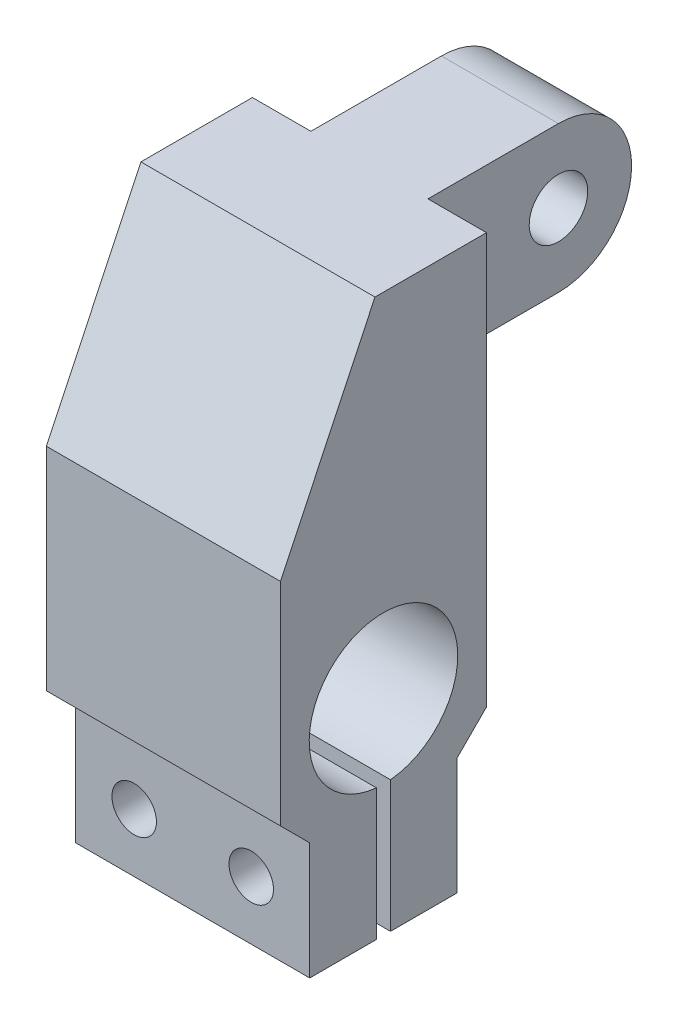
ISO-10303-21;
HEADER;
FILE_DESCRIPTION(('STEP AP214'),'2;1');
FILE_NAME('part.step','',(''),(''),'','','');
FILE_SCHEMA(('AUTOMOTIVE_DESIGN { 1 0 10303 214 1 1 1 1 }'));
ENDSEC;
DATA;
#1=APPLICATION_CONTEXT('core data for automotive mechanical design processes');
#2=APPLICATION_PROTOCOL_DEFINITION('international standard','automotive_design',2000,#1);
#3=PRODUCT_CONTEXT('',#1,'mechanical');
#4=PRODUCT('Part','Part','',(#3));
#5=PRODUCT_RELATED_PRODUCT_CATEGORY('part','',(#4));
#6=PRODUCT_DEFINITION_FORMATION('','',#4);
#7=PRODUCT_DEFINITION_CONTEXT('part definition',#1,'design');
#8=PRODUCT_DEFINITION('design','',#6,#7);
#9=PRODUCT_DEFINITION_SHAPE('','',#8);
#10=(LENGTH_UNIT() NAMED_UNIT(*) SI_UNIT(.MILLI.,.METRE.));
#11=(NAMED_UNIT(*) PLANE_ANGLE_UNIT() SI_UNIT($,.RADIAN.));
#12=(NAMED_UNIT(*) SI_UNIT($,.STERADIAN.) SOLID_ANGLE_UNIT());
#13=UNCERTAINTY_MEASURE_WITH_UNIT(LENGTH_MEASURE(1.E-05),#10,'distance_accuracy_value','');
#14=(GEOMETRIC_REPRESENTATION_CONTEXT(3) GLOBAL_UNCERTAINTY_ASSIGNED_CONTEXT((#13)) GLOBAL_UNIT_ASSIGNED_CONTEXT((#10,
#11,#12)) REPRESENTATION_CONTEXT('',''));
#15=CARTESIAN_POINT('',(0.,0.,0.));
#16=DIRECTION('',(0.,0.,1.));
#17=DIRECTION('',(1.,0.,0.));
#18=AXIS2_PLACEMENT_3D('',#15,#16,#17);
#19=CARTESIAN_POINT('',(25.4,60.452,22.352));
#20=DIRECTION('',(0.,-1.,0.));
#21=DIRECTION('',(0.,0.,-1.));
#22=AXIS2_PLACEMENT_3D('',#19,#20,#21);
#23=PLANE('',#22);
#24=DIRECTION('',(1.,0.,0.));
#25=VECTOR('',#24,1.);
#26=CARTESIAN_POINT('',(-2.50000000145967E-05,60.452,-14.1605));
#27=LINE('',#26,#25);
#28=CARTESIAN_POINT('',(6.35,60.452,-14.1605));
#29=VERTEX_POINT('',#28);
#30=CARTESIAN_POINT('',(19.05,60.452,-14.1605));
#31=VERTEX_POINT('',#30);
#32=EDGE_CURVE('E151',#29,#31,#27,.T.);
#33=ORIENTED_EDGE('',*,*,#32,.F.);
#34=DIRECTION('',(0.,0.,1.));
#35=VECTOR('',#34,1.);
#36=CARTESIAN_POINT('',(6.35,60.452,-22.098));
#37=LINE('',#36,#35);
#38=CARTESIAN_POINT('',(6.35,60.452,0.));
#39=VERTEX_POINT('',#38);
#40=EDGE_CURVE('E169',#29,#39,#37,.T.);
#41=ORIENTED_EDGE('',*,*,#40,.T.);
#42=DIRECTION('',(-1.,0.,0.));
#43=VECTOR('',#42,1.);
#44=CARTESIAN_POINT('',(25.4,60.452,0.));
#45=LINE('',#44,#43);
#46=CARTESIAN_POINT('',(0.,60.452,0.));
#47=VERTEX_POINT('',#46);
#48=EDGE_CURVE('E256',#39,#47,#45,.T.);
#49=ORIENTED_EDGE('',*,*,#48,.T.);
#50=DIRECTION('',(0.,0.,-1.));
#51=VECTOR('',#50,1.);
#52=CARTESIAN_POINT('',(0.,60.452,22.352));
#53=LINE('',#52,#51);
#54=CARTESIAN_POINT('',(0.,60.452,12.0985976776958));
#55=VERTEX_POINT('',#54);
#56=EDGE_CURVE('E285',#55,#47,#53,.T.);
#57=ORIENTED_EDGE('',*,*,#56,.F.);
#58=DIRECTION('',(-1.,0.,0.));
#59=VECTOR('',#58,1.);
#60=CARTESIAN_POINT('',(25.4,60.452,12.0985976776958));
#61=LINE('',#60,#59);
#62=CARTESIAN_POINT('',(25.4,60.452,12.0985976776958));
#63=VERTEX_POINT('',#62);
#64=EDGE_CURVE('E246',#63,#55,#61,.T.);
#65=ORIENTED_EDGE('',*,*,#64,.F.);
#66=DIRECTION('',(0.,0.,-1.));
#67=VECTOR('',#66,1.);
#68=CARTESIAN_POINT('',(25.4,60.452,22.352));
#69=LINE('',#68,#67);
#70=CARTESIAN_POINT('',(25.4,60.452,0.));
#71=VERTEX_POINT('',#70);
#72=EDGE_CURVE('E283',#63,#71,#69,.T.);
#73=ORIENTED_EDGE('',*,*,#72,.T.);
#74=CARTESIAN_POINT('',(19.05,60.452,0.));
#75=VERTEX_POINT('',#74);
#76=EDGE_CURVE('E168',#71,#75,#45,.T.);
#77=ORIENTED_EDGE('',*,*,#76,.T.);
#78=DIRECTION('',(0.,0.,1.));
#79=VECTOR('',#78,1.);
#80=CARTESIAN_POINT('',(19.05,60.452,-22.098));
#81=LINE('',#80,#79);
#82=EDGE_CURVE('E162',#31,#75,#81,.T.);
#83=ORIENTED_EDGE('',*,*,#82,.F.);
#84=EDGE_LOOP('',(#33,#41,#49,#57,#65,#73,#77,#83));
#85=FACE_BOUND('',#84,.T.);
#86=ADVANCED_FACE('F31',(#85),#23,.F.);
#87=CARTESIAN_POINT('',(19.05,60.452,-22.098));
#88=DIRECTION('',(-1.,0.,0.));
#89=DIRECTION('',(0.,-1.,0.));
#90=AXIS2_PLACEMENT_3D('',#87,#88,#89);
#91=PLANE('',#90);
#92=CARTESIAN_POINT('',(19.05,52.5145,-14.1605));
#93=DIRECTION('',(1.,0.,0.));
#94=DIRECTION('',(0.,1.,0.));
#95=AXIS2_PLACEMENT_3D('',#92,#93,#94);
#96=CIRCLE('',#95,3.175);
#97=CARTESIAN_POINT('',(19.05,55.6895,-14.1605));
#98=VERTEX_POINT('',#97);
#99=EDGE_CURVE('E418',#98,#98,#96,.T.);
#100=ORIENTED_EDGE('',*,*,#99,.F.);
#101=EDGE_LOOP('',(#100));
#102=FACE_BOUND('',#101,.T.);
#103=CARTESIAN_POINT('',(19.05,52.5145,-14.1605));
#104=DIRECTION('',(1.,0.,0.));
#105=DIRECTION('',(0.,1.,0.));
#106=AXIS2_PLACEMENT_3D('',#103,#104,#105);
#107=CIRCLE('',#106,7.93750000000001);
#108=CARTESIAN_POINT('',(19.05,44.577,-14.1605));
#109=VERTEX_POINT('',#108);
#110=EDGE_CURVE('E154',#109,#31,#107,.T.);
#111=ORIENTED_EDGE('',*,*,#110,.T.);
#112=ORIENTED_EDGE('',*,*,#82,.T.);
#113=DIRECTION('',(0.,-1.,0.));
#114=VECTOR('',#113,1.);
#115=CARTESIAN_POINT('',(19.05,60.452,0.));
#116=LINE('',#115,#114);
#117=CARTESIAN_POINT('',(19.05,44.577,0.));
#118=VERTEX_POINT('',#117);
#119=EDGE_CURVE('E184',#75,#118,#116,.T.);
#120=ORIENTED_EDGE('',*,*,#119,.T.);
#121=DIRECTION('',(0.,0.,1.));
#122=VECTOR('',#121,1.);
#123=CARTESIAN_POINT('',(19.05,44.577,-22.098));
#124=LINE('',#123,#122);
#125=EDGE_CURVE('E55',#109,#118,#124,.T.);
#126=ORIENTED_EDGE('',*,*,#125,.F.);
#127=EDGE_LOOP('',(#111,#112,#120,#126));
#128=FACE_BOUND('',#127,.T.);
#129=ADVANCED_FACE('F161',(#102,#128),#91,.F.);
#130=CARTESIAN_POINT('',(6.35,44.577,-22.098));
#131=DIRECTION('',(1.,0.,0.));
#132=DIRECTION('',(0.,0.,-1.));
#133=AXIS2_PLACEMENT_3D('',#130,#131,#132);
#134=PLANE('',#133);
#135=CARTESIAN_POINT('',(6.35,52.5145,-14.1605));
#136=DIRECTION('',(1.,0.,0.));
#137=DIRECTION('',(0.,0.,-1.));
#138=AXIS2_PLACEMENT_3D('',#135,#136,#137);
#139=CIRCLE('',#138,3.175);
#140=CARTESIAN_POINT('',(6.35,55.6895,-14.1605));
#141=VERTEX_POINT('',#140);
#142=EDGE_CURVE('E164',#141,#141,#139,.T.);
#143=ORIENTED_EDGE('',*,*,#142,.T.);
#144=EDGE_LOOP('',(#143));
#145=FACE_BOUND('',#144,.T.);
#146=ORIENTED_EDGE('',*,*,#40,.F.);
#147=CARTESIAN_POINT('',(6.35,52.5145,-14.1605));
#148=DIRECTION('',(1.,0.,0.));
#149=DIRECTION('',(0.,0.,-1.));
#150=AXIS2_PLACEMENT_3D('',#147,#148,#149);
#151=CIRCLE('',#150,7.93750000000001);
#152=CARTESIAN_POINT('',(6.35,44.577,-14.1605));
#153=VERTEX_POINT('',#152);
#154=EDGE_CURVE('E155',#153,#29,#151,.T.);
#155=ORIENTED_EDGE('',*,*,#154,.F.);
#156=DIRECTION('',(0.,0.,1.));
#157=VECTOR('',#156,1.);
#158=CARTESIAN_POINT('',(6.35,44.577,-22.098));
#159=LINE('',#158,#157);
#160=CARTESIAN_POINT('',(6.35,44.577,0.));
#161=VERTEX_POINT('',#160);
#162=EDGE_CURVE('E172',#153,#161,#159,.T.);
#163=ORIENTED_EDGE('',*,*,#162,.T.);
#164=DIRECTION('',(0.,1.,0.));
#165=VECTOR('',#164,1.);
#166=CARTESIAN_POINT('',(6.35,44.577,0.));
#167=LINE('',#166,#165);
#168=EDGE_CURVE('E170',#161,#39,#167,.T.);
#169=ORIENTED_EDGE('',*,*,#168,.T.);
#170=EDGE_LOOP('',(#146,#155,#163,#169));
#171=FACE_BOUND('',#170,.T.);
#172=ADVANCED_FACE('F319',(#145,#171),#134,.F.);
#173=CARTESIAN_POINT('',(0.,60.452,0.));
#174=DIRECTION('',(0.,0.,1.));
#175=DIRECTION('',(1.,0.,0.));
#176=AXIS2_PLACEMENT_3D('',#173,#174,#175);
#177=PLANE('',#176);
#178=ORIENTED_EDGE('',*,*,#119,.F.);
#179=ORIENTED_EDGE('',*,*,#76,.F.);
#180=DIRECTION('',(0.,-1.,0.));
#181=VECTOR('',#180,1.);
#182=CARTESIAN_POINT('',(25.4,60.452,0.));
#183=LINE('',#182,#181);
#184=CARTESIAN_POINT('',(25.4,15.875,0.));
#185=VERTEX_POINT('',#184);
#186=EDGE_CURVE('E259',#71,#185,#183,.T.);
#187=ORIENTED_EDGE('',*,*,#186,.T.);
#188=DIRECTION('',(-1.,0.,0.));
#189=VECTOR('',#188,1.);
#190=CARTESIAN_POINT('',(0.,15.875,0.));
#191=LINE('',#190,#189);
#192=CARTESIAN_POINT('',(0.,15.875,0.));
#193=VERTEX_POINT('',#192);
#194=EDGE_CURVE('E272',#185,#193,#191,.T.);
#195=ORIENTED_EDGE('',*,*,#194,.T.);
#196=DIRECTION('',(0.,1.,0.));
#197=VECTOR('',#196,1.);
#198=CARTESIAN_POINT('',(0.,0.,0.));
#199=LINE('',#198,#197);
#200=EDGE_CURVE('E253',#193,#47,#199,.T.);
#201=ORIENTED_EDGE('',*,*,#200,.T.);
#202=ORIENTED_EDGE('',*,*,#48,.F.);
#203=ORIENTED_EDGE('',*,*,#168,.F.);
#204=DIRECTION('',(1.,0.,0.));
#205=VECTOR('',#204,1.);
#206=CARTESIAN_POINT('',(6.35,44.577,0.));
#207=LINE('',#206,#205);
#208=EDGE_CURVE('E175',#161,#118,#207,.T.);
#209=ORIENTED_EDGE('',*,*,#208,.T.);
#210=EDGE_LOOP('',(#178,#179,#187,#195,#201,#202,#203,#209));
#211=FACE_BOUND('',#210,.T.);
#212=ADVANCED_FACE('F298',(#211),#177,.F.);
#213=CARTESIAN_POINT('',(0.,0.,22.352));
#214=DIRECTION('',(0.,1.,0.));
#215=DIRECTION('',(0.,0.,1.));
#216=AXIS2_PLACEMENT_3D('',#213,#214,#215);
#217=PLANE('',#216);
#218=DIRECTION('',(1.,0.,0.));
#219=VECTOR('',#218,1.);
#220=CARTESIAN_POINT('',(0.,0.,10.414));
#221=LINE('',#220,#219);
#222=CARTESIAN_POINT('',(0.,0.,10.414));
#223=VERTEX_POINT('',#222);
#224=CARTESIAN_POINT('',(25.4,0.,10.414));
#225=VERTEX_POINT('',#224);
#226=EDGE_CURVE('E203',#223,#225,#221,.T.);
#227=ORIENTED_EDGE('',*,*,#226,.F.);
#228=DIRECTION('',(0.,0.,-1.));
#229=VECTOR('',#228,1.);
#230=CARTESIAN_POINT('',(0.,0.,22.352));
#231=LINE('',#230,#229);
#232=CARTESIAN_POINT('',(0.,0.,3.175));
#233=VERTEX_POINT('',#232);
#234=EDGE_CURVE('E278',#223,#233,#231,.T.);
#235=ORIENTED_EDGE('',*,*,#234,.T.);
#236=DIRECTION('',(1.,0.,0.));
#237=VECTOR('',#236,1.);
#238=CARTESIAN_POINT('',(0.,0.,3.175));
#239=LINE('',#238,#237);
#240=CARTESIAN_POINT('',(25.4,0.,3.175));
#241=VERTEX_POINT('',#240);
#242=EDGE_CURVE('E248',#233,#241,#239,.T.);
#243=ORIENTED_EDGE('',*,*,#242,.T.);
#244=DIRECTION('',(0.,0.,-1.));
#245=VECTOR('',#244,1.);
#246=CARTESIAN_POINT('',(25.4,0.,22.352));
#247=LINE('',#246,#245);
#248=EDGE_CURVE('E282',#225,#241,#247,.T.);
#249=ORIENTED_EDGE('',*,*,#248,.F.);
#250=EDGE_LOOP('',(#227,#235,#243,#249));
#251=FACE_BOUND('',#250,.T.);
#252=ADVANCED_FACE('F353',(#251),#217,.F.);
#253=CARTESIAN_POINT('',(0.,0.,22.352));
#254=DIRECTION('',(-1.,0.,0.));
#255=DIRECTION('',(0.,0.,1.));
#256=AXIS2_PLACEMENT_3D('',#253,#254,#255);
#257=PLANE('',#256);
#258=DIRECTION('',(0.,-1.,0.));
#259=VECTOR('',#258,1.);
#260=CARTESIAN_POINT('',(0.,15.875,11.938));
#261=LINE('',#260,#259);
#262=CARTESIAN_POINT('',(0.,14.2507150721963,11.938));
#263=VERTEX_POINT('',#262);
#264=CARTESIAN_POINT('',(0.,0.,11.938));
#265=VERTEX_POINT('',#264);
#266=EDGE_CURVE('E200',#263,#265,#261,.T.);
#267=ORIENTED_EDGE('',*,*,#266,.T.);
#268=CARTESIAN_POINT('',(0.,0.,19.177));
#269=VERTEX_POINT('',#268);
#270=EDGE_CURVE('E275',#269,#265,#231,.T.);
#271=ORIENTED_EDGE('',*,*,#270,.F.);
#272=DIRECTION('',(0.,-1.,0.));
#273=VECTOR('',#272,1.);
#274=CARTESIAN_POINT('',(0.,12.7,19.177));
#275=LINE('',#274,#273);
#276=CARTESIAN_POINT('',(0.,12.7,19.177));
#277=VERTEX_POINT('',#276);
#278=EDGE_CURVE('E237',#277,#269,#275,.T.);
#279=ORIENTED_EDGE('',*,*,#278,.F.);
#280=DIRECTION('',(0.,-0.707106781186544,-0.707106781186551));
#281=VECTOR('',#280,1.);
#282=CARTESIAN_POINT('',(0.,21.2602168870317,27.7372168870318));
#283=LINE('',#282,#281);
#284=CARTESIAN_POINT('',(0.,15.875,22.352));
#285=VERTEX_POINT('',#284);
#286=EDGE_CURVE('E239',#285,#277,#283,.T.);
#287=ORIENTED_EDGE('',*,*,#286,.F.);
#288=DIRECTION('',(0.,1.,0.));
#289=VECTOR('',#288,1.);
#290=CARTESIAN_POINT('',(0.,0.,22.352));
#291=LINE('',#290,#289);
#292=CARTESIAN_POINT('',(0.,38.8583848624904,22.352));
#293=VERTEX_POINT('',#292);
#294=EDGE_CURVE('E290',#285,#293,#291,.T.);
#295=ORIENTED_EDGE('',*,*,#294,.T.);
#296=DIRECTION('',(0.,0.9033352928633,-0.428935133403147));
#297=VECTOR('',#296,1.);
#298=CARTESIAN_POINT('',(0.,58.6028956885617,12.9766169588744));
#299=LINE('',#298,#297);
#300=EDGE_CURVE('E228',#293,#55,#299,.T.);
#301=ORIENTED_EDGE('',*,*,#300,.T.);
#302=ORIENTED_EDGE('',*,*,#56,.T.);
#303=ORIENTED_EDGE('',*,*,#200,.F.);
#304=DIRECTION('',(0.,-0.707106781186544,0.707106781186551));
#305=VECTOR('',#304,1.);
#306=CARTESIAN_POINT('',(0.,17.618714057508,-1.74371405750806));
#307=LINE('',#306,#305);
#308=CARTESIAN_POINT('',(0.,12.7,3.175));
#309=VERTEX_POINT('',#308);
#310=EDGE_CURVE('E231',#193,#309,#307,.T.);
#311=ORIENTED_EDGE('',*,*,#310,.T.);
#312=DIRECTION('',(0.,-1.,0.));
#313=VECTOR('',#312,1.);
#314=CARTESIAN_POINT('',(0.,12.7,3.175));
#315=LINE('',#314,#313);
#316=EDGE_CURVE('E234',#309,#233,#315,.T.);
#317=ORIENTED_EDGE('',*,*,#316,.T.);
#318=ORIENTED_EDGE('',*,*,#234,.F.);
#319=DIRECTION('',(0.,-1.,0.));
#320=VECTOR('',#319,1.);
#321=CARTESIAN_POINT('',(0.,15.875,10.414));
#322=LINE('',#321,#320);
#323=CARTESIAN_POINT('',(0.,14.2507150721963,10.414));
#324=VERTEX_POINT('',#323);
#325=EDGE_CURVE('E198',#324,#223,#322,.T.);
#326=ORIENTED_EDGE('',*,*,#325,.F.);
#327=CARTESIAN_POINT('',(0.,22.2758,11.176));
#328=DIRECTION('',(1.,0.,0.));
#329=DIRECTION('',(0.,1.,0.));
#330=AXIS2_PLACEMENT_3D('',#327,#328,#329);
#331=CIRCLE('',#330,8.06118056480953);
#332=EDGE_CURVE('E208',#324,#263,#331,.T.);
#333=ORIENTED_EDGE('',*,*,#332,.T.);
#334=EDGE_LOOP('',(#267,#271,#279,#287,#295,#301,#302,#303,#311,#317,#318,#326,#333));
#335=FACE_BOUND('',#334,.T.);
#336=ADVANCED_FACE('F313',(#335),#257,.T.);
#337=ORIENTED_EDGE('',*,*,#270,.T.);
#338=DIRECTION('',(1.,0.,0.));
#339=VECTOR('',#338,1.);
#340=CARTESIAN_POINT('',(0.,0.,11.938));
#341=LINE('',#340,#339);
#342=CARTESIAN_POINT('',(25.4,0.,11.938));
#343=VERTEX_POINT('',#342);
#344=EDGE_CURVE('E205',#265,#343,#341,.T.);
#345=ORIENTED_EDGE('',*,*,#344,.T.);
#346=CARTESIAN_POINT('',(25.4,0.,19.177));
#347=VERTEX_POINT('',#346);
#348=EDGE_CURVE('E279',#347,#343,#247,.T.);
#349=ORIENTED_EDGE('',*,*,#348,.F.);
#350=DIRECTION('',(1.,0.,0.));
#351=VECTOR('',#350,1.);
#352=CARTESIAN_POINT('',(0.,0.,19.177));
#353=LINE('',#352,#351);
#354=EDGE_CURVE('E251',#269,#347,#353,.T.);
#355=ORIENTED_EDGE('',*,*,#354,.F.);
#356=EDGE_LOOP('',(#337,#345,#349,#355));
#357=FACE_BOUND('',#356,.T.);
#358=ADVANCED_FACE('F33',(#357),#217,.F.);
#359=CARTESIAN_POINT('',(25.4,60.452,22.352));
#360=DIRECTION('',(1.,0.,0.));
#361=DIRECTION('',(0.,1.,0.));
#362=AXIS2_PLACEMENT_3D('',#359,#360,#361);
#363=PLANE('',#362);
#364=DIRECTION('',(0.,-1.,0.));
#365=VECTOR('',#364,1.);
#366=CARTESIAN_POINT('',(25.4,15.875,11.938));
#367=LINE('',#366,#365);
#368=CARTESIAN_POINT('',(25.4,14.2507150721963,11.938));
#369=VERTEX_POINT('',#368);
#370=EDGE_CURVE('E196',#369,#343,#367,.T.);
#371=ORIENTED_EDGE('',*,*,#370,.F.);
#372=CARTESIAN_POINT('',(25.4,22.2758,11.176));
#373=DIRECTION('',(1.,0.,0.));
#374=DIRECTION('',(0.,1.,0.));
#375=AXIS2_PLACEMENT_3D('',#372,#373,#374);
#376=CIRCLE('',#375,8.06118056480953);
#377=CARTESIAN_POINT('',(25.4,14.2507150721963,10.414));
#378=VERTEX_POINT('',#377);
#379=EDGE_CURVE('E211',#378,#369,#376,.T.);
#380=ORIENTED_EDGE('',*,*,#379,.F.);
#381=DIRECTION('',(0.,-1.,0.));
#382=VECTOR('',#381,1.);
#383=CARTESIAN_POINT('',(25.4,15.875,10.414));
#384=LINE('',#383,#382);
#385=EDGE_CURVE('E193',#378,#225,#384,.T.);
#386=ORIENTED_EDGE('',*,*,#385,.T.);
#387=ORIENTED_EDGE('',*,*,#248,.T.);
#388=DIRECTION('',(0.,-1.,0.));
#389=VECTOR('',#388,1.);
#390=CARTESIAN_POINT('',(25.4,12.7,3.175));
#391=LINE('',#390,#389);
#392=CARTESIAN_POINT('',(25.4,12.7,3.175));
#393=VERTEX_POINT('',#392);
#394=EDGE_CURVE('E216',#393,#241,#391,.T.);
#395=ORIENTED_EDGE('',*,*,#394,.F.);
#396=DIRECTION('',(0.,-0.707106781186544,0.707106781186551));
#397=VECTOR('',#396,1.);
#398=CARTESIAN_POINT('',(25.4,17.618714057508,-1.74371405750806));
#399=LINE('',#398,#397);
#400=EDGE_CURVE('E214',#185,#393,#399,.T.);
#401=ORIENTED_EDGE('',*,*,#400,.F.);
#402=ORIENTED_EDGE('',*,*,#186,.F.);
#403=ORIENTED_EDGE('',*,*,#72,.F.);
#404=DIRECTION('',(0.,-0.9033352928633,0.428935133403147));
#405=VECTOR('',#404,1.);
#406=CARTESIAN_POINT('',(25.4,58.6028956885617,12.9766169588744));
#407=LINE('',#406,#405);
#408=CARTESIAN_POINT('',(25.4,38.8583848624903,22.352));
#409=VERTEX_POINT('',#408);
#410=EDGE_CURVE('E225',#63,#409,#407,.T.);
#411=ORIENTED_EDGE('',*,*,#410,.T.);
#412=DIRECTION('',(0.,-1.,0.));
#413=VECTOR('',#412,1.);
#414=CARTESIAN_POINT('',(25.4,60.452,22.352));
#415=LINE('',#414,#413);
#416=CARTESIAN_POINT('',(25.4,15.875,22.352));
#417=VERTEX_POINT('',#416);
#418=EDGE_CURVE('E288',#409,#417,#415,.T.);
#419=ORIENTED_EDGE('',*,*,#418,.T.);
#420=DIRECTION('',(0.,-0.707106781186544,-0.707106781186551));
#421=VECTOR('',#420,1.);
#422=CARTESIAN_POINT('',(25.4,21.2602168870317,27.7372168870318));
#423=LINE('',#422,#421);
#424=CARTESIAN_POINT('',(25.4,12.7,19.177));
#425=VERTEX_POINT('',#424);
#426=EDGE_CURVE('E222',#417,#425,#423,.T.);
#427=ORIENTED_EDGE('',*,*,#426,.T.);
#428=DIRECTION('',(0.,-1.,0.));
#429=VECTOR('',#428,1.);
#430=CARTESIAN_POINT('',(25.4,12.7,19.177));
#431=LINE('',#430,#429);
#432=EDGE_CURVE('E219',#425,#347,#431,.T.);
#433=ORIENTED_EDGE('',*,*,#432,.T.);
#434=ORIENTED_EDGE('',*,*,#348,.T.);
#435=EDGE_LOOP('',(#371,#380,#386,#387,#395,#401,#402,#403,#411,#419,#427,#433,#434));
#436=FACE_BOUND('',#435,.T.);
#437=ADVANCED_FACE('F304',(#436),#363,.T.);
#438=CARTESIAN_POINT('',(0.,60.452,22.352));
#439=DIRECTION('',(0.,0.,1.));
#440=DIRECTION('',(1.,0.,0.));
#441=AXIS2_PLACEMENT_3D('',#438,#439,#440);
#442=PLANE('',#441);
#443=ORIENTED_EDGE('',*,*,#418,.F.);
#444=DIRECTION('',(-1.,0.,0.));
#445=VECTOR('',#444,1.);
#446=CARTESIAN_POINT('',(0.,38.8583848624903,22.352));
#447=LINE('',#446,#445);
#448=EDGE_CURVE('E266',#409,#293,#447,.T.);
#449=ORIENTED_EDGE('',*,*,#448,.T.);
#450=ORIENTED_EDGE('',*,*,#294,.F.);
#451=DIRECTION('',(1.,0.,0.));
#452=VECTOR('',#451,1.);
#453=CARTESIAN_POINT('',(0.,15.875,22.352));
#454=LINE('',#453,#452);
#455=EDGE_CURVE('E269',#285,#417,#454,.T.);
#456=ORIENTED_EDGE('',*,*,#455,.T.);
#457=EDGE_LOOP('',(#443,#449,#450,#456));
#458=FACE_BOUND('',#457,.T.);
#459=ADVANCED_FACE('F346',(#458),#442,.T.);
#460=CARTESIAN_POINT('',(0.,17.618714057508,-1.74371405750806));
#461=DIRECTION('',(0.,0.707106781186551,0.707106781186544));
#462=DIRECTION('',(0.,-0.707106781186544,0.707106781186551));
#463=AXIS2_PLACEMENT_3D('',#460,#461,#462);
#464=PLANE('',#463);
#465=ORIENTED_EDGE('',*,*,#400,.T.);
#466=DIRECTION('',(1.,0.,0.));
#467=VECTOR('',#466,1.);
#468=CARTESIAN_POINT('',(0.,12.7,3.175));
#469=LINE('',#468,#467);
#470=EDGE_CURVE('E241',#309,#393,#469,.T.);
#471=ORIENTED_EDGE('',*,*,#470,.F.);
#472=ORIENTED_EDGE('',*,*,#310,.F.);
#473=ORIENTED_EDGE('',*,*,#194,.F.);
#474=EDGE_LOOP('',(#465,#471,#472,#473));
#475=FACE_BOUND('',#474,.T.);
#476=ADVANCED_FACE('F307',(#475),#464,.F.);
#477=CARTESIAN_POINT('',(0.,12.7,3.175));
#478=DIRECTION('',(0.,0.,1.));
#479=DIRECTION('',(1.,0.,0.));
#480=AXIS2_PLACEMENT_3D('',#477,#478,#479);
#481=PLANE('',#480);
#482=CARTESIAN_POINT('',(6.35000000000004,6.34999999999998,3.175));
#483=DIRECTION('',(0.,0.,1.));
#484=DIRECTION('',(1.,0.,0.));
#485=AXIS2_PLACEMENT_3D('',#482,#483,#484);
#486=CIRCLE('',#485,2.413);
#487=CARTESIAN_POINT('',(8.76300000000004,6.34999999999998,3.175));
#488=VERTEX_POINT('',#487);
#489=EDGE_CURVE('E574',#488,#488,#486,.T.);
#490=ORIENTED_EDGE('',*,*,#489,.T.);
#491=EDGE_LOOP('',(#490));
#492=FACE_BOUND('',#491,.T.);
#493=CARTESIAN_POINT('',(19.05,6.34999999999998,3.175));
#494=DIRECTION('',(0.,0.,1.));
#495=DIRECTION('',(1.,0.,0.));
#496=AXIS2_PLACEMENT_3D('',#493,#494,#495);
#497=CIRCLE('',#496,2.413);
#498=CARTESIAN_POINT('',(21.463,6.34999999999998,3.175));
#499=VERTEX_POINT('',#498);
#500=EDGE_CURVE('E414',#499,#499,#497,.T.);
#501=ORIENTED_EDGE('',*,*,#500,.T.);
#502=EDGE_LOOP('',(#501));
#503=FACE_BOUND('',#502,.T.);
#504=ORIENTED_EDGE('',*,*,#316,.F.);
#505=ORIENTED_EDGE('',*,*,#470,.T.);
#506=ORIENTED_EDGE('',*,*,#394,.T.);
#507=ORIENTED_EDGE('',*,*,#242,.F.);
#508=EDGE_LOOP('',(#504,#505,#506,#507));
#509=FACE_BOUND('',#508,.T.);
#510=ADVANCED_FACE('F310',(#492,#503,#509),#481,.F.);
#511=CARTESIAN_POINT('',(0.,21.2602168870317,27.7372168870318));
#512=DIRECTION('',(0.,-0.707106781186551,0.707106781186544));
#513=DIRECTION('',(0.,-0.707106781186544,-0.707106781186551));
#514=AXIS2_PLACEMENT_3D('',#511,#512,#513);
#515=PLANE('',#514);
#516=ORIENTED_EDGE('',*,*,#286,.T.);
#517=DIRECTION('',(1.,0.,0.));
#518=VECTOR('',#517,1.);
#519=CARTESIAN_POINT('',(0.,12.7,19.177));
#520=LINE('',#519,#518);
#521=EDGE_CURVE('E244',#277,#425,#520,.T.);
#522=ORIENTED_EDGE('',*,*,#521,.T.);
#523=ORIENTED_EDGE('',*,*,#426,.F.);
#524=ORIENTED_EDGE('',*,*,#455,.F.);
#525=EDGE_LOOP('',(#516,#522,#523,#524));
#526=FACE_BOUND('',#525,.T.);
#527=ADVANCED_FACE('F382',(#526),#515,.T.);
#528=CARTESIAN_POINT('',(0.,12.7,19.177));
#529=DIRECTION('',(0.,0.,1.));
#530=DIRECTION('',(1.,0.,0.));
#531=AXIS2_PLACEMENT_3D('',#528,#529,#530);
#532=PLANE('',#531);
#533=CARTESIAN_POINT('',(6.35000000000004,6.34999999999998,19.177));
#534=DIRECTION('',(0.,0.,1.));
#535=DIRECTION('',(1.,0.,0.));
#536=AXIS2_PLACEMENT_3D('',#533,#534,#535);
#537=CIRCLE('',#536,2.413);
#538=CARTESIAN_POINT('',(8.76300000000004,6.34999999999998,19.177));
#539=VERTEX_POINT('',#538);
#540=EDGE_CURVE('E578',#539,#539,#537,.T.);
#541=ORIENTED_EDGE('',*,*,#540,.F.);
#542=EDGE_LOOP('',(#541));
#543=FACE_BOUND('',#542,.T.);
#544=CARTESIAN_POINT('',(19.05,6.34999999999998,19.177));
#545=DIRECTION('',(0.,0.,1.));
#546=DIRECTION('',(1.,0.,0.));
#547=AXIS2_PLACEMENT_3D('',#544,#545,#546);
#548=CIRCLE('',#547,2.413);
#549=CARTESIAN_POINT('',(21.463,6.34999999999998,19.177));
#550=VERTEX_POINT('',#549);
#551=EDGE_CURVE('E421',#550,#550,#548,.T.);
#552=ORIENTED_EDGE('',*,*,#551,.F.);
#553=EDGE_LOOP('',(#552));
#554=FACE_BOUND('',#553,.T.);
#555=ORIENTED_EDGE('',*,*,#354,.T.);
#556=ORIENTED_EDGE('',*,*,#432,.F.);
#557=ORIENTED_EDGE('',*,*,#521,.F.);
#558=ORIENTED_EDGE('',*,*,#278,.T.);
#559=EDGE_LOOP('',(#555,#556,#557,#558));
#560=FACE_BOUND('',#559,.T.);
#561=ADVANCED_FACE('F380',(#543,#554,#560),#532,.T.);
#562=CARTESIAN_POINT('',(0.,58.6028956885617,12.9766169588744));
#563=DIRECTION('',(0.,0.428935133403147,0.9033352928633));
#564=DIRECTION('',(0.,-0.9033352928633,0.428935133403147));
#565=AXIS2_PLACEMENT_3D('',#562,#563,#564);
#566=PLANE('',#565);
#567=ORIENTED_EDGE('',*,*,#64,.T.);
#568=ORIENTED_EDGE('',*,*,#300,.F.);
#569=ORIENTED_EDGE('',*,*,#448,.F.);
#570=ORIENTED_EDGE('',*,*,#410,.F.);
#571=EDGE_LOOP('',(#567,#568,#569,#570));
#572=FACE_BOUND('',#571,.T.);
#573=ADVANCED_FACE('F385',(#572),#566,.T.);
#574=CARTESIAN_POINT('',(0.,22.2758,11.176));
#575=DIRECTION('',(1.,0.,0.));
#576=DIRECTION('',(0.,1.,0.));
#577=AXIS2_PLACEMENT_3D('',#574,#575,#576);
#578=CYLINDRICAL_SURFACE('',#577,8.06118056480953);
#579=ORIENTED_EDGE('',*,*,#379,.T.);
#580=DIRECTION('',(1.,0.,0.));
#581=VECTOR('',#580,1.);
#582=CARTESIAN_POINT('',(0.,14.2507150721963,11.938));
#583=LINE('',#582,#581);
#584=EDGE_CURVE('E11',#369,#263,#583,.F.);
#585=ORIENTED_EDGE('',*,*,#584,.T.);
#586=ORIENTED_EDGE('',*,*,#332,.F.);
#587=DIRECTION('',(1.,0.,0.));
#588=VECTOR('',#587,1.);
#589=CARTESIAN_POINT('',(0.,14.2507150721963,10.414));
#590=LINE('',#589,#588);
#591=EDGE_CURVE('E40',#378,#324,#590,.F.);
#592=ORIENTED_EDGE('',*,*,#591,.F.);
#593=EDGE_LOOP('',(#579,#585,#586,#592));
#594=FACE_BOUND('',#593,.T.);
#595=ADVANCED_FACE('F370',(#594),#578,.F.);
#596=CARTESIAN_POINT('',(0.,15.875,10.414));
#597=DIRECTION('',(0.,0.,1.));
#598=DIRECTION('',(0.,-1.,0.));
#599=AXIS2_PLACEMENT_3D('',#596,#597,#598);
#600=PLANE('',#599);
#601=CARTESIAN_POINT('',(6.35000000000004,6.34999999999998,10.414));
#602=DIRECTION('',(0.,0.,1.));
#603=DIRECTION('',(0.,-1.,0.));
#604=AXIS2_PLACEMENT_3D('',#601,#602,#603);
#605=CIRCLE('',#604,2.413);
#606=CARTESIAN_POINT('',(6.35000000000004,3.93699999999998,10.414));
#607=VERTEX_POINT('',#606);
#608=EDGE_CURVE('E409',#607,#607,#605,.T.);
#609=ORIENTED_EDGE('',*,*,#608,.F.);
#610=EDGE_LOOP('',(#609));
#611=FACE_BOUND('',#610,.T.);
#612=CARTESIAN_POINT('',(19.05,6.34999999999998,10.414));
#613=DIRECTION('',(0.,0.,1.));
#614=DIRECTION('',(0.,-1.,0.));
#615=AXIS2_PLACEMENT_3D('',#612,#613,#614);
#616=CIRCLE('',#615,2.413);
#617=CARTESIAN_POINT('',(19.05,3.93699999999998,10.414));
#618=VERTEX_POINT('',#617);
#619=EDGE_CURVE('E412',#618,#618,#616,.T.);
#620=ORIENTED_EDGE('',*,*,#619,.F.);
#621=EDGE_LOOP('',(#620));
#622=FACE_BOUND('',#621,.T.);
#623=ORIENTED_EDGE('',*,*,#226,.T.);
#624=ORIENTED_EDGE('',*,*,#385,.F.);
#625=ORIENTED_EDGE('',*,*,#591,.T.);
#626=ORIENTED_EDGE('',*,*,#325,.T.);
#627=EDGE_LOOP('',(#623,#624,#625,#626));
#628=FACE_BOUND('',#627,.T.);
#629=ADVANCED_FACE('F331',(#611,#622,#628),#600,.T.);
#630=CARTESIAN_POINT('',(0.,15.875,11.938));
#631=DIRECTION('',(0.,0.,1.));
#632=DIRECTION('',(0.,-1.,0.));
#633=AXIS2_PLACEMENT_3D('',#630,#631,#632);
#634=PLANE('',#633);
#635=CARTESIAN_POINT('',(6.35000000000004,6.34999999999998,11.938));
#636=DIRECTION('',(0.,0.,1.));
#637=DIRECTION('',(0.,-1.,0.));
#638=AXIS2_PLACEMENT_3D('',#635,#636,#637);
#639=CIRCLE('',#638,2.413);
#640=CARTESIAN_POINT('',(6.35000000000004,3.93699999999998,11.938));
#641=VERTEX_POINT('',#640);
#642=EDGE_CURVE('E35',#641,#641,#639,.T.);
#643=ORIENTED_EDGE('',*,*,#642,.T.);
#644=EDGE_LOOP('',(#643));
#645=FACE_BOUND('',#644,.T.);
#646=CARTESIAN_POINT('',(19.05,6.34999999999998,11.938));
#647=DIRECTION('',(0.,0.,1.));
#648=DIRECTION('',(0.,-1.,0.));
#649=AXIS2_PLACEMENT_3D('',#646,#647,#648);
#650=CIRCLE('',#649,2.413);
#651=CARTESIAN_POINT('',(19.05,3.93699999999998,11.938));
#652=VERTEX_POINT('',#651);
#653=EDGE_CURVE('E415',#652,#652,#650,.T.);
#654=ORIENTED_EDGE('',*,*,#653,.T.);
#655=EDGE_LOOP('',(#654));
#656=FACE_BOUND('',#655,.T.);
#657=ORIENTED_EDGE('',*,*,#266,.F.);
#658=ORIENTED_EDGE('',*,*,#584,.F.);
#659=ORIENTED_EDGE('',*,*,#370,.T.);
#660=ORIENTED_EDGE('',*,*,#344,.F.);
#661=EDGE_LOOP('',(#657,#658,#659,#660));
#662=FACE_BOUND('',#661,.T.);
#663=ADVANCED_FACE('F323',(#645,#656,#662),#634,.F.);
#664=CARTESIAN_POINT('',(6.35,44.577,-22.098));
#665=DIRECTION('',(0.,-1.,0.));
#666=DIRECTION('',(0.,0.,-1.));
#667=AXIS2_PLACEMENT_3D('',#664,#665,#666);
#668=PLANE('',#667);
#669=DIRECTION('',(1.,0.,0.));
#670=VECTOR('',#669,1.);
#671=CARTESIAN_POINT('',(-2.50000000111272E-05,44.577,-14.1605));
#672=LINE('',#671,#670);
#673=EDGE_CURVE('E48',#153,#109,#672,.T.);
#674=ORIENTED_EDGE('',*,*,#673,.T.);
#675=ORIENTED_EDGE('',*,*,#125,.T.);
#676=ORIENTED_EDGE('',*,*,#208,.F.);
#677=ORIENTED_EDGE('',*,*,#162,.F.);
#678=EDGE_LOOP('',(#674,#675,#676,#677));
#679=FACE_BOUND('',#678,.T.);
#680=ADVANCED_FACE('F321',(#679),#668,.T.);
#681=CARTESIAN_POINT('',(-2.50000000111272E-05,52.5145,-14.1605));
#682=DIRECTION('',(1.,0.,0.));
#683=DIRECTION('',(0.,1.,0.));
#684=AXIS2_PLACEMENT_3D('',#681,#682,#683);
#685=CYLINDRICAL_SURFACE('',#684,7.93750000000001);
#686=ORIENTED_EDGE('',*,*,#154,.T.);
#687=ORIENTED_EDGE('',*,*,#32,.T.);
#688=ORIENTED_EDGE('',*,*,#110,.F.);
#689=ORIENTED_EDGE('',*,*,#673,.F.);
#690=EDGE_LOOP('',(#686,#687,#688,#689));
#691=FACE_BOUND('',#690,.T.);
#692=ADVANCED_FACE('F153',(#691),#685,.T.);
#693=CARTESIAN_POINT('',(-2.50000000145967E-05,52.5145,-14.1605));
#694=DIRECTION('',(1.,0.,0.));
#695=DIRECTION('',(0.,1.,0.));
#696=AXIS2_PLACEMENT_3D('',#693,#694,#695);
#697=CYLINDRICAL_SURFACE('',#696,3.175);
#698=CARTESIAN_POINT('',(19.05,55.6895,-14.1605));
#699=CARTESIAN_POINT('',(18.9177083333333,55.6895,-14.1605));
#700=CARTESIAN_POINT('',(18.7854166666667,55.6895,-14.1605));
#701=CARTESIAN_POINT('',(18.5208333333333,55.6895,-14.1605));
#702=CARTESIAN_POINT('',(18.3885416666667,55.6895,-14.1605));
#703=CARTESIAN_POINT('',(18.1239583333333,55.6895,-14.1605));
#704=CARTESIAN_POINT('',(17.9916666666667,55.6895,-14.1605));
#705=CARTESIAN_POINT('',(17.7270833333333,55.6895,-14.1605));
#706=CARTESIAN_POINT('',(17.5947916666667,55.6895,-14.1605));
#707=CARTESIAN_POINT('',(17.3302083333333,55.6895,-14.1605));
#708=CARTESIAN_POINT('',(17.1979166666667,55.6895,-14.1605));
#709=CARTESIAN_POINT('',(16.9333333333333,55.6895,-14.1605));
#710=CARTESIAN_POINT('',(16.8010416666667,55.6895,-14.1605));
#711=CARTESIAN_POINT('',(16.5364583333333,55.6895,-14.1605));
#712=CARTESIAN_POINT('',(16.4041666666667,55.6895,-14.1605));
#713=CARTESIAN_POINT('',(16.1395833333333,55.6895,-14.1605));
#714=CARTESIAN_POINT('',(16.0072916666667,55.6895,-14.1605));
#715=CARTESIAN_POINT('',(15.7427083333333,55.6895,-14.1605));
#716=CARTESIAN_POINT('',(15.6104166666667,55.6895,-14.1605));
#717=CARTESIAN_POINT('',(15.3458333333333,55.6895,-14.1605));
#718=CARTESIAN_POINT('',(15.2135416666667,55.6895,-14.1605));
#719=CARTESIAN_POINT('',(14.9489583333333,55.6895,-14.1605));
#720=CARTESIAN_POINT('',(14.8166666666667,55.6895,-14.1605));
#721=CARTESIAN_POINT('',(14.5520833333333,55.6895,-14.1605));
#722=CARTESIAN_POINT('',(14.4197916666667,55.6895,-14.1605));
#723=CARTESIAN_POINT('',(14.1552083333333,55.6895,-14.1605));
#724=CARTESIAN_POINT('',(14.0229166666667,55.6895,-14.1605));
#725=CARTESIAN_POINT('',(13.7583333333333,55.6895,-14.1605));
#726=CARTESIAN_POINT('',(13.6260416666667,55.6895,-14.1605));
#727=CARTESIAN_POINT('',(13.3614583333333,55.6895,-14.1605));
#728=CARTESIAN_POINT('',(13.2291666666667,55.6895,-14.1605));
#729=CARTESIAN_POINT('',(12.9645833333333,55.6895,-14.1605));
#730=CARTESIAN_POINT('',(12.8322916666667,55.6895,-14.1605));
#731=CARTESIAN_POINT('',(12.5677083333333,55.6895,-14.1605));
#732=CARTESIAN_POINT('',(12.4354166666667,55.6895,-14.1605));
#733=CARTESIAN_POINT('',(12.1708333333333,55.6895,-14.1605));
#734=CARTESIAN_POINT('',(12.0385416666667,55.6895,-14.1605));
#735=CARTESIAN_POINT('',(11.7739583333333,55.6895,-14.1605));
#736=CARTESIAN_POINT('',(11.6416666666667,55.6895,-14.1605));
#737=CARTESIAN_POINT('',(11.3770833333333,55.6895,-14.1605));
#738=CARTESIAN_POINT('',(11.2447916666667,55.6895,-14.1605));
#739=CARTESIAN_POINT('',(10.9802083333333,55.6895,-14.1605));
#740=CARTESIAN_POINT('',(10.8479166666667,55.6895,-14.1605));
#741=CARTESIAN_POINT('',(10.5833333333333,55.6895,-14.1605));
#742=CARTESIAN_POINT('',(10.4510416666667,55.6895,-14.1605));
#743=CARTESIAN_POINT('',(10.1864583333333,55.6895,-14.1605));
#744=CARTESIAN_POINT('',(10.0541666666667,55.6895,-14.1605));
#745=CARTESIAN_POINT('',(9.78958333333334,55.6895,-14.1605));
#746=CARTESIAN_POINT('',(9.65729166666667,55.6895,-14.1605));
#747=CARTESIAN_POINT('',(9.39270833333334,55.6895,-14.1605));
#748=CARTESIAN_POINT('',(9.26041666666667,55.6895,-14.1605));
#749=CARTESIAN_POINT('',(8.99583333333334,55.6895,-14.1605));
#750=CARTESIAN_POINT('',(8.86354166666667,55.6895,-14.1605));
#751=CARTESIAN_POINT('',(8.59895833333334,55.6895,-14.1605));
#752=CARTESIAN_POINT('',(8.46666666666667,55.6895,-14.1605));
#753=CARTESIAN_POINT('',(8.20208333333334,55.6895,-14.1605));
#754=CARTESIAN_POINT('',(8.06979166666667,55.6895,-14.1605));
#755=CARTESIAN_POINT('',(7.80520833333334,55.6895,-14.1605));
#756=CARTESIAN_POINT('',(7.67291666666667,55.6895,-14.1605));
#757=CARTESIAN_POINT('',(7.40833333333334,55.6895,-14.1605));
#758=CARTESIAN_POINT('',(7.27604166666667,55.6895,-14.1605));
#759=CARTESIAN_POINT('',(7.01145833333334,55.6895,-14.1605));
#760=CARTESIAN_POINT('',(6.87916666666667,55.6895,-14.1605));
#761=CARTESIAN_POINT('',(6.61458333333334,55.6895,-14.1605));
#762=CARTESIAN_POINT('',(6.48229166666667,55.6895,-14.1605));
#763=CARTESIAN_POINT('',(6.35,55.6895,-14.1605));
#764=B_SPLINE_CURVE_WITH_KNOTS('',3,(#698,#699,#700,#701,#702,#703,#704,#705,#706,#707,#708,
#709,#710,#711,#712,#713,#714,#715,#716,#717,#718,#719,#720,#721,#722,#723,#724,#725,#726,#727,
#728,#729,#730,#731,#732,#733,#734,#735,#736,#737,#738,#739,#740,#741,#742,#743,#744,#745,#746,
#747,#748,#749,#750,#751,#752,#753,#754,#755,#756,#757,#758,#759,#760,#761,#762,#763),
.UNSPECIFIED.,.F.,.F.,(4,2,2,2,2,2,2,2,2,2,2,2,2,2,2,2,2,2,2,2,2,2,2,2,2,2,2,2,2,2,2,2,4),(0.,
0.396875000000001,0.793749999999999,1.190625,1.5875,1.984375,2.38125,2.778125,3.175,3.571875,
3.96875,4.365625,4.7625,5.159375,5.55625,5.953125,6.35,6.746875,7.14375,7.540625,7.9375,
8.334375,8.73125,9.128125,9.525,9.921875,10.31875,10.715625,11.1125,11.509375,11.90625,
12.303125,12.7),.UNSPECIFIED.);
#765=EDGE_CURVE('BSEAM329',#98,#141,#764,.T.);
#766=ORIENTED_EDGE('',*,*,#99,.T.);
#767=ORIENTED_EDGE('',*,*,#142,.F.);
#768=ORIENTED_EDGE('',*,*,#765,.T.);
#769=ORIENTED_EDGE('',*,*,#765,.F.);
#770=EDGE_LOOP('',(#766,#768,#767,#769));
#771=FACE_BOUND('',#770,.T.);
#772=ADVANCED_FACE('F329',(#771),#697,.F.);
#773=CARTESIAN_POINT('',(19.05,6.34999999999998,-22.098));
#774=DIRECTION('',(0.,0.,1.));
#775=DIRECTION('',(1.,0.,0.));
#776=AXIS2_PLACEMENT_3D('',#773,#774,#775);
#777=CYLINDRICAL_SURFACE('',#776,2.413);
#778=ORIENTED_EDGE('',*,*,#551,.T.);
#779=EDGE_LOOP('',(#778));
#780=FACE_BOUND('',#779,.T.);
#781=ORIENTED_EDGE('',*,*,#653,.F.);
#782=EDGE_LOOP('',(#781));
#783=FACE_BOUND('',#782,.T.);
#784=ADVANCED_FACE('F434',(#780,#783),#777,.F.);
#785=ORIENTED_EDGE('',*,*,#619,.T.);
#786=EDGE_LOOP('',(#785));
#787=FACE_BOUND('',#786,.T.);
#788=ORIENTED_EDGE('',*,*,#500,.F.);
#789=EDGE_LOOP('',(#788));
#790=FACE_BOUND('',#789,.T.);
#791=ADVANCED_FACE('F439',(#787,#790),#777,.F.);
#792=CARTESIAN_POINT('',(6.35000000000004,6.34999999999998,-22.098));
#793=DIRECTION('',(0.,0.,1.));
#794=DIRECTION('',(1.,0.,0.));
#795=AXIS2_PLACEMENT_3D('',#792,#793,#794);
#796=CYLINDRICAL_SURFACE('',#795,2.413);
#797=ORIENTED_EDGE('',*,*,#540,.T.);
#798=EDGE_LOOP('',(#797));
#799=FACE_BOUND('',#798,.T.);
#800=ORIENTED_EDGE('',*,*,#642,.F.);
#801=EDGE_LOOP('',(#800));
#802=FACE_BOUND('',#801,.T.);
#803=ADVANCED_FACE('F551',(#799,#802),#796,.F.);
#804=ORIENTED_EDGE('',*,*,#608,.T.);
#805=EDGE_LOOP('',(#804));
#806=FACE_BOUND('',#805,.T.);
#807=ORIENTED_EDGE('',*,*,#489,.F.);
#808=EDGE_LOOP('',(#807));
#809=FACE_BOUND('',#808,.T.);
#810=ADVANCED_FACE('F559',(#806,#809),#796,.F.);
#811=CLOSED_SHELL('',(#86,#129,#172,#212,#252,#336,#358,#437,#459,#476,#510,#527,#561,#573,#595,
#629,#663,#680,#692,#772,#784,#791,#803,#810));
#812=MANIFOLD_SOLID_BREP('B2',#811);
#813=ADVANCED_BREP_SHAPE_REPRESENTATION('',(#18,#812),#14);
#814=SHAPE_DEFINITION_REPRESENTATION(#9,#813);
ENDSEC;
END-ISO-10303-21;
